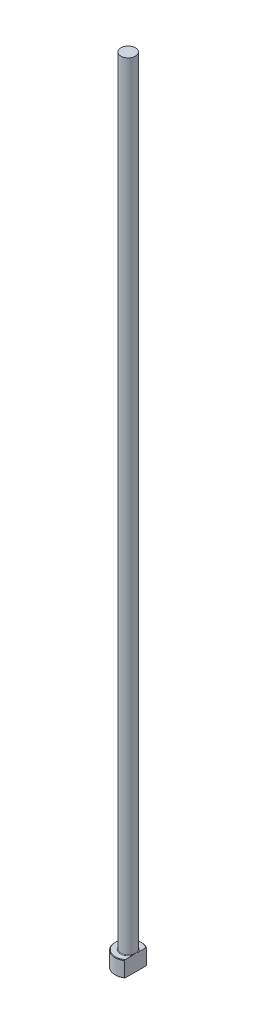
from build123d import *
from build123d.topology import SkipClean

# Parameters (mm, degrees)
CHAMFER1_SIZE    = 0.2
FILLET1_R        = 0.2
KEYED_HEAD_DEPTH = 301.083321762


with BuildPart() as part:
    # Sketch1 → Revolve1 (revolve)
    with BuildSketch(Plane.XY, mode=Mode.PRIVATE) as revolve1_sk:
        Polygon((0, 0), (-5, 0), (-5, 6), (-2.75, 6), (-2.75, 300), (0, 300), align=None)
    revolve(revolve1_sk.sketch.rotate(Axis((0, 259.958771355, 0), (0, -1, 0)), 270), axis=Axis((0, 259.958771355, 0), (0, -1, 0)))

    # Chamfer1
    chamfer1_edges = [part.edges().sort_by_distance(p)[0] for p in [
        (0, 6, -5),
        (0, 0, -5),
    ]]
    chamfer(chamfer1_edges, length=CHAMFER1_SIZE)

    # Fillet1
    fillet1_edges = [part.edges().sort_by_distance(p)[0] for p in [
        (0, 6, -2.75),
    ]]
    fillet(fillet1_edges, radius=FILLET1_R)

    # Sketch2 → KEYED HEAD (cut, through all)
    with SkipClean():  # the faces are left unmerged after this step: merging them gives an invalid solid
        with BuildSketch(Plane(origin=(0, 0, 0), x_dir=(1, 0, 0), z_dir=(0, 1, 0))):
            with BuildLine():
                Line((2.75, -4.175823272), (2.75, 4.175823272))
                ThreePointArc((2.75, 4.175823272), (5, 0), (2.75, -4.175823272))
            make_face()
        extrude(amount=KEYED_HEAD_DEPTH, mode=Mode.SUBTRACT)


solid = part.part
